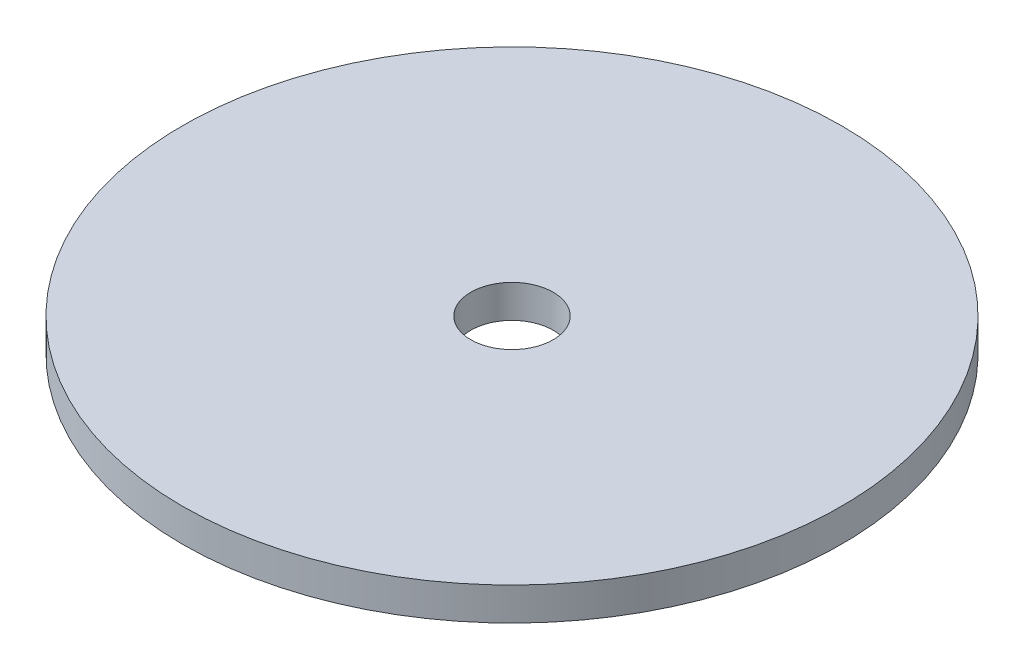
from build123d import *

# Parameters (mm, degrees)
SKETCH1_R           = 20
SKETCH1_R_2         = 2.5
BOSS_EXTRUDE1_DEPTH = 2


with BuildPart() as part:
    # Sketch1 → Boss-Extrude1 (new body)
    with BuildSketch(Plane(origin=(0, 0, 0), x_dir=(1, 0, 0), z_dir=(0, 1, 0))):
        with Locations(Location((0, 0, 0), (0, 0, 270))):
            Circle(SKETCH1_R)
        with Locations(Location((0, 0, 0), (0, 0, 270))):
            Circle(SKETCH1_R_2, mode=Mode.SUBTRACT)
    extrude(amount=BOSS_EXTRUDE1_DEPTH)


solid = part.part
